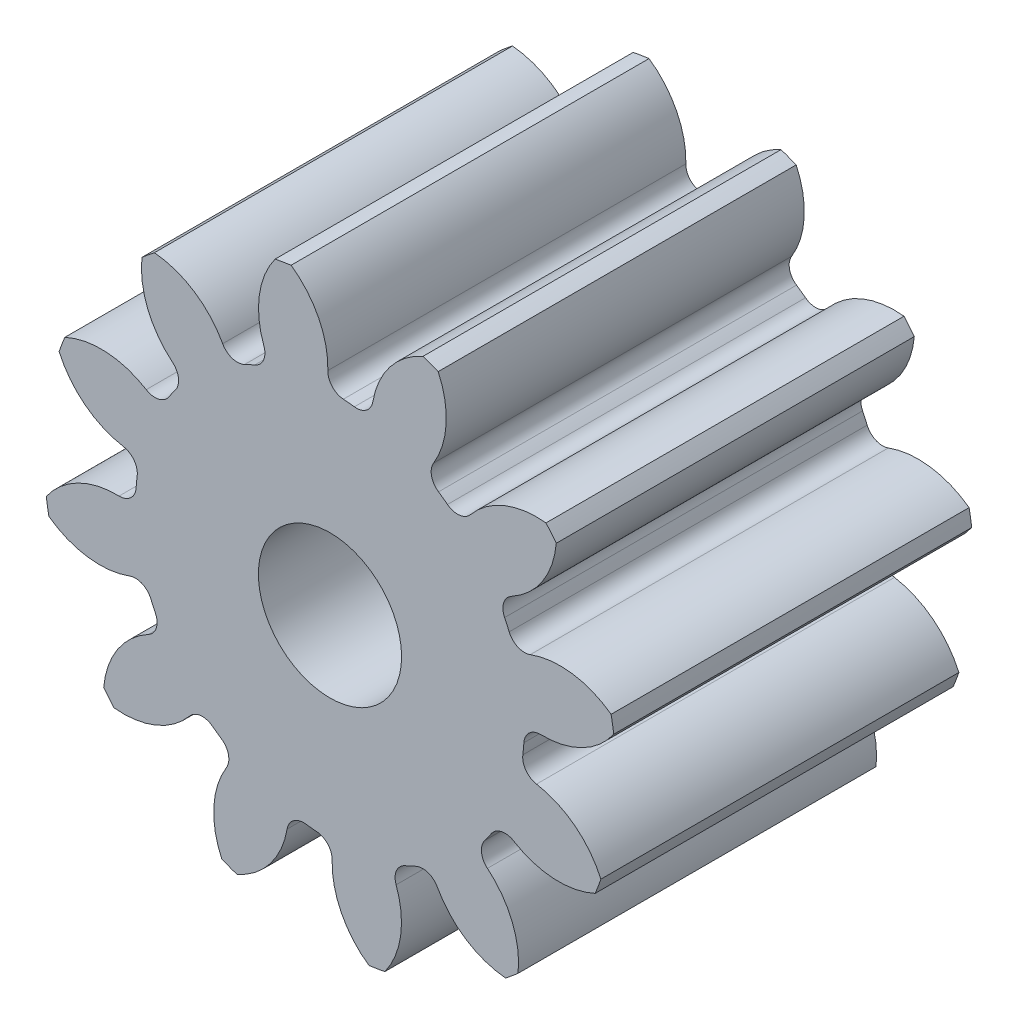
from build123d import *

# Parameters (mm, degrees)
SKETCH3_R         = 71.12
GEARBODY_DEPTH    = 88.9
TOOTHCUT_DEPTH    = 135.236056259
CIRPATTERN1_COUNT = 12
BOREDIA_R         = 17.78
BORE_DEPTH        = 12700


with BuildPart() as part:
    # Sketch3 → gearBody (new body)
    with BuildSketch(Plane.XY):
        Circle(SKETCH3_R)
    extrude(amount=GEARBODY_DEPTH)

    # Sketch2 → toothCut (cut, through all)
    with BuildSketch(Plane.XY):
        with BuildLine():
            ThreePointArc((47.878797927, -6.053784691), (48.031745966, -4.688174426), (48.145751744, -3.318763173))
            ThreePointArc((48.145751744, -3.318763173), (49.488275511, -0.54450117), (52.376694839, 0.530642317))
            ThreePointArc((52.376694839, 0.530642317), (63.099228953, 3.098216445), (71.12, 10.663426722))
            ThreePointArc((71.12, 10.663426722), (71.574836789, -6.986115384), (67.715705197, -24.214589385))
            ThreePointArc((67.715705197, -24.214589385), (61.309197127, -15.241193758), (51.285529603, -10.64867113))
            ThreePointArc((51.285529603, -10.64867113), (48.659525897, -9.035288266), (47.878797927, -6.053784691))
        make_face()
    toothcut = extrude(amount=TOOTHCUT_DEPTH, mode=Mode.SUBTRACT)

    # CirPattern1: toothCut ×12 about axis
    cirpattern1_axis = Axis((0, 0, 0), (0, 0, 1))
    for i in range(1, CIRPATTERN1_COUNT):
        add(toothcut.rotate(cirpattern1_axis, i * 360 / CIRPATTERN1_COUNT), mode=Mode.SUBTRACT)

    # boreDia → bore (cut, symmetric)
    with BuildSketch(Plane.XY):
        Circle(BOREDIA_R)
    extrude(amount=BORE_DEPTH, both=True, mode=Mode.SUBTRACT)


solid = part.part
